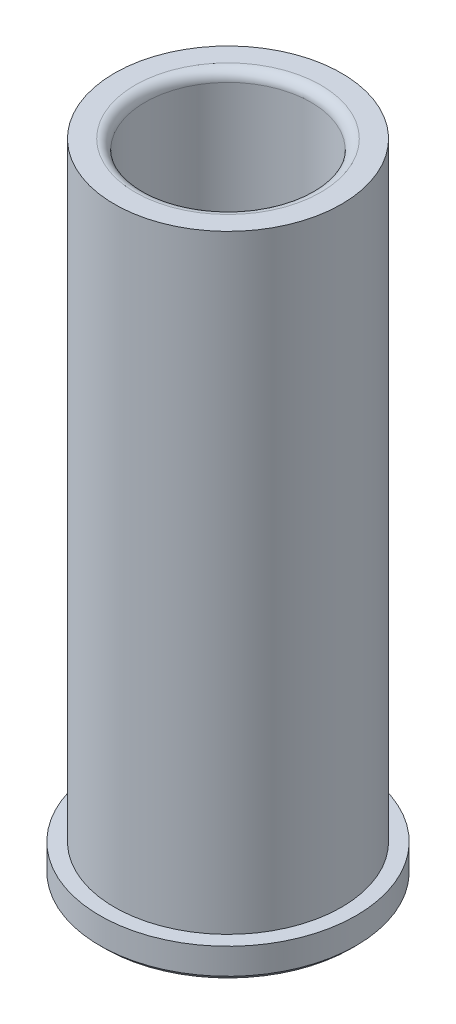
ISO-10303-21;
HEADER;
FILE_DESCRIPTION(('STEP AP214'),'2;1');
FILE_NAME('part.step','',(''),(''),'','','');
FILE_SCHEMA(('AUTOMOTIVE_DESIGN { 1 0 10303 214 1 1 1 1 }'));
ENDSEC;
DATA;
#1=APPLICATION_CONTEXT('core data for automotive mechanical design processes');
#2=APPLICATION_PROTOCOL_DEFINITION('international standard','automotive_design',2000,#1);
#3=PRODUCT_CONTEXT('',#1,'mechanical');
#4=PRODUCT('Part','Part','',(#3));
#5=PRODUCT_RELATED_PRODUCT_CATEGORY('part','',(#4));
#6=PRODUCT_DEFINITION_FORMATION('','',#4);
#7=PRODUCT_DEFINITION_CONTEXT('part definition',#1,'design');
#8=PRODUCT_DEFINITION('design','',#6,#7);
#9=PRODUCT_DEFINITION_SHAPE('','',#8);
#10=(LENGTH_UNIT() NAMED_UNIT(*) SI_UNIT(.MILLI.,.METRE.));
#11=(NAMED_UNIT(*) PLANE_ANGLE_UNIT() SI_UNIT($,.RADIAN.));
#12=(NAMED_UNIT(*) SI_UNIT($,.STERADIAN.) SOLID_ANGLE_UNIT());
#13=UNCERTAINTY_MEASURE_WITH_UNIT(LENGTH_MEASURE(1.E-05),#10,'distance_accuracy_value','');
#14=(GEOMETRIC_REPRESENTATION_CONTEXT(3) GLOBAL_UNCERTAINTY_ASSIGNED_CONTEXT((#13)) GLOBAL_UNIT_ASSIGNED_CONTEXT((#10,
#11,#12)) REPRESENTATION_CONTEXT('',''));
#15=CARTESIAN_POINT('',(0.,0.,0.));
#16=DIRECTION('',(0.,0.,1.));
#17=DIRECTION('',(1.,0.,0.));
#18=AXIS2_PLACEMENT_3D('',#15,#16,#17);
#19=CARTESIAN_POINT('',(3.49148336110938E-12,-1000.,0.));
#20=DIRECTION('',(0.,-1.,0.));
#21=DIRECTION('',(1.,0.,0.));
#22=AXIS2_PLACEMENT_3D('',#19,#20,#21);
#23=CYLINDRICAL_SURFACE('',#22,17.4688499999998);
#24=CARTESIAN_POINT('',(0.,4.7625,0.));
#25=DIRECTION('',(0.,-1.,0.));
#26=DIRECTION('',(1.,0.,0.));
#27=AXIS2_PLACEMENT_3D('',#24,#25,#26);
#28=CIRCLE('',#27,17.46885);
#29=CARTESIAN_POINT('',(17.4688499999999,4.76250000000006,0.));
#30=VERTEX_POINT('',#29);
#31=EDGE_CURVE('E60',#30,#30,#28,.T.);
#32=ORIENTED_EDGE('',*,*,#31,.F.);
#33=EDGE_LOOP('',(#32));
#34=FACE_BOUND('',#33,.T.);
#35=CARTESIAN_POINT('',(-3.43649249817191E-13,98.425,0.));
#36=DIRECTION('',(0.,-1.,0.));
#37=DIRECTION('',(1.,0.,0.));
#38=AXIS2_PLACEMENT_3D('',#35,#36,#37);
#39=CIRCLE('',#38,17.4688499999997);
#40=CARTESIAN_POINT('',(17.4688499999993,98.425,0.));
#41=VERTEX_POINT('',#40);
#42=EDGE_CURVE('E39',#41,#41,#39,.T.);
#43=ORIENTED_EDGE('',*,*,#42,.T.);
#44=EDGE_LOOP('',(#43));
#45=FACE_BOUND('',#44,.T.);
#46=ADVANCED_FACE('F28',(#34,#45),#23,.T.);
#47=CARTESIAN_POINT('',(-17.46885,98.425,0.));
#48=DIRECTION('',(0.,-1.,0.));
#49=DIRECTION('',(1.,0.,0.));
#50=AXIS2_PLACEMENT_3D('',#47,#48,#49);
#51=PLANE('',#50);
#52=CARTESIAN_POINT('',(-3.43649249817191E-13,98.425,0.));
#53=DIRECTION('',(0.,-1.,0.));
#54=DIRECTION('',(1.,0.,0.));
#55=AXIS2_PLACEMENT_3D('',#52,#53,#54);
#56=CIRCLE('',#55,14.2874999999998);
#57=CARTESIAN_POINT('',(14.2874999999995,98.4250000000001,0.));
#58=VERTEX_POINT('',#57);
#59=EDGE_CURVE('E35',#58,#58,#56,.T.);
#60=ORIENTED_EDGE('',*,*,#59,.T.);
#61=EDGE_LOOP('',(#60));
#62=FACE_BOUND('',#61,.T.);
#63=ORIENTED_EDGE('',*,*,#42,.F.);
#64=EDGE_LOOP('',(#63));
#65=FACE_BOUND('',#64,.T.);
#66=ADVANCED_FACE('F68',(#62,#65),#51,.F.);
#67=CARTESIAN_POINT('',(3.49148336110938E-12,-1000.,0.));
#68=DIRECTION('',(0.,-1.,0.));
#69=DIRECTION('',(1.,0.,0.));
#70=AXIS2_PLACEMENT_3D('',#67,#68,#69);
#71=CYLINDRICAL_SURFACE('',#70,12.7634999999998);
#72=CARTESIAN_POINT('',(-3.3832822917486E-13,96.9009999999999,0.));
#73=DIRECTION('',(0.,-1.,0.));
#74=DIRECTION('',(1.,0.,0.));
#75=AXIS2_PLACEMENT_3D('',#72,#73,#74);
#76=CIRCLE('',#75,12.7634999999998);
#77=CARTESIAN_POINT('',(12.7634999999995,96.9009999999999,0.));
#78=VERTEX_POINT('',#77);
#79=EDGE_CURVE('E10',#78,#78,#76,.F.);
#80=ORIENTED_EDGE('',*,*,#79,.T.);
#81=EDGE_LOOP('',(#80));
#82=FACE_BOUND('',#81,.T.);
#83=CARTESIAN_POINT('',(0.,0.761999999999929,0.));
#84=DIRECTION('',(0.,-1.,0.));
#85=DIRECTION('',(1.,0.,0.));
#86=AXIS2_PLACEMENT_3D('',#83,#84,#85);
#87=CIRCLE('',#86,12.7635);
#88=CARTESIAN_POINT('',(12.7635,0.761999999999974,0.));
#89=VERTEX_POINT('',#88);
#90=EDGE_CURVE('E43',#89,#89,#87,.T.);
#91=ORIENTED_EDGE('',*,*,#90,.T.);
#92=EDGE_LOOP('',(#91));
#93=FACE_BOUND('',#92,.T.);
#94=ADVANCED_FACE('F72',(#82,#93),#71,.F.);
#95=CARTESIAN_POINT('',(0.,0.,0.));
#96=DIRECTION('',(0.,-1.,0.));
#97=DIRECTION('',(1.,0.,0.));
#98=AXIS2_PLACEMENT_3D('',#95,#96,#97);
#99=CONICAL_SURFACE('',#98,13.5255,0.785398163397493);
#100=ORIENTED_EDGE('',*,*,#90,.F.);
#101=EDGE_LOOP('',(#100));
#102=FACE_BOUND('',#101,.T.);
#103=CARTESIAN_POINT('',(0.,0.,0.));
#104=DIRECTION('',(0.,-1.,0.));
#105=DIRECTION('',(1.,0.,0.));
#106=AXIS2_PLACEMENT_3D('',#103,#104,#105);
#107=CIRCLE('',#106,13.5255);
#108=CARTESIAN_POINT('',(13.5255,0.,0.));
#109=VERTEX_POINT('',#108);
#110=EDGE_CURVE('E48',#109,#109,#107,.T.);
#111=ORIENTED_EDGE('',*,*,#110,.T.);
#112=EDGE_LOOP('',(#111));
#113=FACE_BOUND('',#112,.T.);
#114=ADVANCED_FACE('F77',(#102,#113),#99,.F.);
#115=CARTESIAN_POINT('',(-13.5255,0.,0.));
#116=DIRECTION('',(0.,1.,0.));
#117=DIRECTION('',(-1.,0.,0.));
#118=AXIS2_PLACEMENT_3D('',#115,#116,#117);
#119=PLANE('',#118);
#120=ORIENTED_EDGE('',*,*,#110,.F.);
#121=EDGE_LOOP('',(#120));
#122=FACE_BOUND('',#121,.T.);
#123=CARTESIAN_POINT('',(0.,0.,0.));
#124=DIRECTION('',(0.,-1.,0.));
#125=DIRECTION('',(1.,0.,0.));
#126=AXIS2_PLACEMENT_3D('',#123,#124,#125);
#127=CIRCLE('',#126,18.9484);
#128=CARTESIAN_POINT('',(18.9484,0.,0.));
#129=VERTEX_POINT('',#128);
#130=EDGE_CURVE('E51',#129,#129,#127,.T.);
#131=ORIENTED_EDGE('',*,*,#130,.T.);
#132=EDGE_LOOP('',(#131));
#133=FACE_BOUND('',#132,.T.);
#134=ADVANCED_FACE('F82',(#122,#133),#119,.F.);
#135=CARTESIAN_POINT('',(0.,0.761999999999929,0.));
#136=DIRECTION('',(0.,1.,0.));
#137=DIRECTION('',(-1.,0.,0.));
#138=AXIS2_PLACEMENT_3D('',#135,#136,#137);
#139=CONICAL_SURFACE('',#138,19.7104,0.785398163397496);
#140=ORIENTED_EDGE('',*,*,#130,.F.);
#141=EDGE_LOOP('',(#140));
#142=FACE_BOUND('',#141,.T.);
#143=CARTESIAN_POINT('',(0.,0.761999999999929,0.));
#144=DIRECTION('',(0.,-1.,0.));
#145=DIRECTION('',(1.,0.,0.));
#146=AXIS2_PLACEMENT_3D('',#143,#144,#145);
#147=CIRCLE('',#146,19.7104);
#148=CARTESIAN_POINT('',(19.7104,0.761999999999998,0.));
#149=VERTEX_POINT('',#148);
#150=EDGE_CURVE('E54',#149,#149,#147,.T.);
#151=ORIENTED_EDGE('',*,*,#150,.T.);
#152=EDGE_LOOP('',(#151));
#153=FACE_BOUND('',#152,.T.);
#154=ADVANCED_FACE('F86',(#142,#153),#139,.T.);
#155=CARTESIAN_POINT('',(3.49148336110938E-12,-1000.,0.));
#156=DIRECTION('',(0.,-1.,0.));
#157=DIRECTION('',(1.,0.,0.));
#158=AXIS2_PLACEMENT_3D('',#155,#156,#157);
#159=CYLINDRICAL_SURFACE('',#158,19.7104);
#160=ORIENTED_EDGE('',*,*,#150,.F.);
#161=EDGE_LOOP('',(#160));
#162=FACE_BOUND('',#161,.T.);
#163=CARTESIAN_POINT('',(0.,4.7625,0.));
#164=DIRECTION('',(0.,-1.,0.));
#165=DIRECTION('',(1.,0.,0.));
#166=AXIS2_PLACEMENT_3D('',#163,#164,#165);
#167=CIRCLE('',#166,19.7104);
#168=CARTESIAN_POINT('',(19.7104,4.76250000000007,0.));
#169=VERTEX_POINT('',#168);
#170=EDGE_CURVE('E57',#169,#169,#167,.T.);
#171=ORIENTED_EDGE('',*,*,#170,.T.);
#172=EDGE_LOOP('',(#171));
#173=FACE_BOUND('',#172,.T.);
#174=ADVANCED_FACE('F90',(#162,#173),#159,.T.);
#175=CARTESIAN_POINT('',(-19.7104,4.76249999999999,0.));
#176=DIRECTION('',(0.,-1.,0.));
#177=DIRECTION('',(1.,0.,0.));
#178=AXIS2_PLACEMENT_3D('',#175,#176,#177);
#179=PLANE('',#178);
#180=ORIENTED_EDGE('',*,*,#170,.F.);
#181=EDGE_LOOP('',(#180));
#182=FACE_BOUND('',#181,.T.);
#183=ORIENTED_EDGE('',*,*,#31,.T.);
#184=EDGE_LOOP('',(#183));
#185=FACE_BOUND('',#184,.T.);
#186=ADVANCED_FACE('F64',(#182,#185),#179,.F.);
#187=CARTESIAN_POINT('',(-3.3832822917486E-13,96.9009999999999,0.));
#188=DIRECTION('',(0.,-1.,0.));
#189=DIRECTION('',(1.,0.,0.));
#190=AXIS2_PLACEMENT_3D('',#187,#188,#189);
#191=TOROIDAL_SURFACE('',#190,14.2874999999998,1.524);
#192=ORIENTED_EDGE('',*,*,#79,.F.);
#193=EDGE_LOOP('',(#192));
#194=FACE_BOUND('',#193,.T.);
#195=ORIENTED_EDGE('',*,*,#59,.F.);
#196=EDGE_LOOP('',(#195));
#197=FACE_BOUND('',#196,.T.);
#198=ADVANCED_FACE('F30',(#194,#197),#191,.T.);
#199=CLOSED_SHELL('',(#46,#66,#94,#114,#134,#154,#174,#186,#198));
#200=MANIFOLD_SOLID_BREP('B2',#199);
#201=ADVANCED_BREP_SHAPE_REPRESENTATION('',(#18,#200),#14);
#202=SHAPE_DEFINITION_REPRESENTATION(#9,#201);
ENDSEC;
END-ISO-10303-21;
